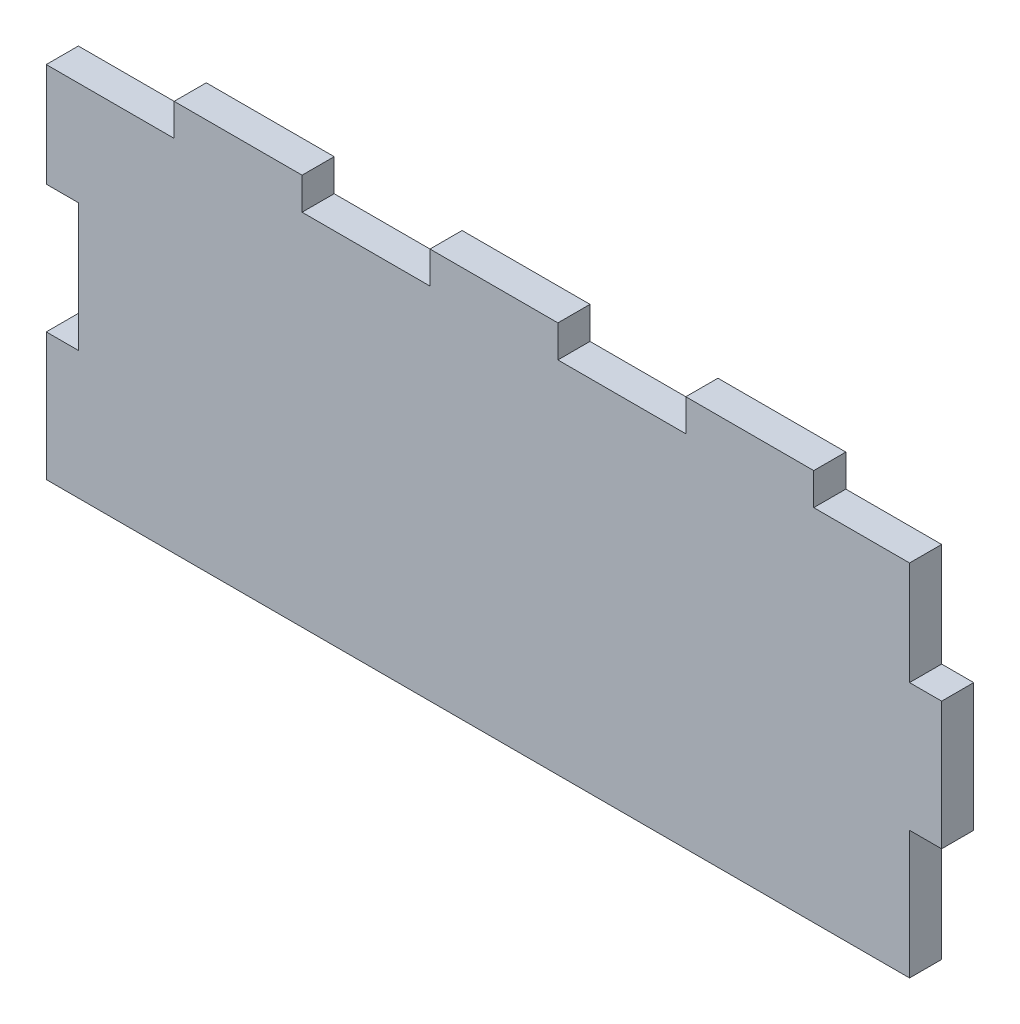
from build123d import *

# Parameters (mm, degrees)
BOSS_EXTRUDE1_DEPTH = 19


with BuildPart() as part:
    # Sketch1 → Boss-Extrude1 (new body)
    with BuildSketch(Plane.XY):
        Polygon((341.454623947, 411.424420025), (852.454623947, 411.424420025), (852.454623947, 487.138706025), (871.454623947, 487.138706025), (871.454623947, 562.852992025), (852.454623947, 562.852992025), (852.454623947, 624.181563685), (795.740339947, 624.181563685), (795.740339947, 643.181563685), (720.026053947, 643.181563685), (720.026053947, 624.181563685), (644.311767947, 624.181563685), (644.311767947, 643.181563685), (568.597481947, 643.181563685), (568.597481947, 624.181563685), (492.883195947, 624.181563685), (492.883195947, 643.181563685), (417.168909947, 643.181563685), (417.168909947, 624.181563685), (341.454623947, 624.181563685), (341.454623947, 562.852992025), (360.454623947, 562.852992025), (360.454623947, 487.138706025), (341.454623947, 487.138706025), align=None)
    extrude(amount=BOSS_EXTRUDE1_DEPTH)


solid = part.part
